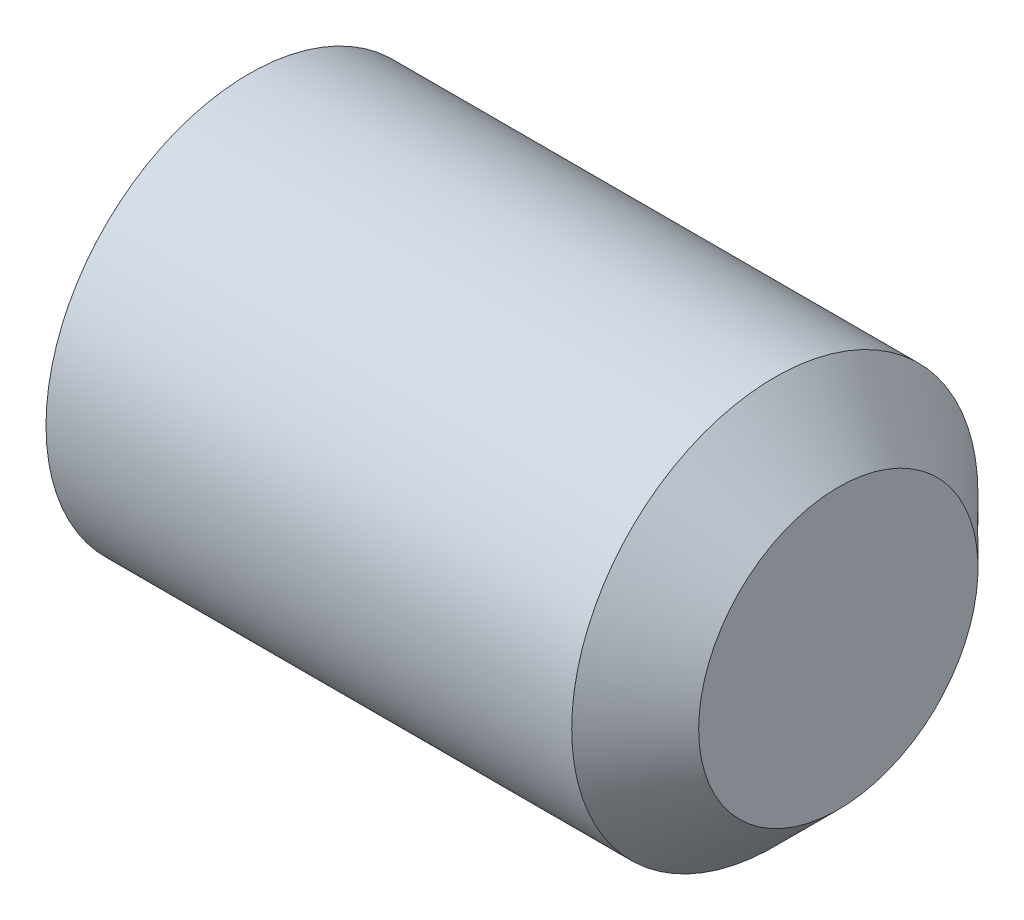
ISO-10303-21;
HEADER;
FILE_DESCRIPTION(('STEP AP214'),'2;1');
FILE_NAME('part.step','',(''),(''),'','','');
FILE_SCHEMA(('AUTOMOTIVE_DESIGN { 1 0 10303 214 1 1 1 1 }'));
ENDSEC;
DATA;
#1=APPLICATION_CONTEXT('core data for automotive mechanical design processes');
#2=APPLICATION_PROTOCOL_DEFINITION('international standard','automotive_design',2000,#1);
#3=PRODUCT_CONTEXT('',#1,'mechanical');
#4=PRODUCT('Part','Part','',(#3));
#5=PRODUCT_RELATED_PRODUCT_CATEGORY('part','',(#4));
#6=PRODUCT_DEFINITION_FORMATION('','',#4);
#7=PRODUCT_DEFINITION_CONTEXT('part definition',#1,'design');
#8=PRODUCT_DEFINITION('design','',#6,#7);
#9=PRODUCT_DEFINITION_SHAPE('','',#8);
#10=(LENGTH_UNIT() NAMED_UNIT(*) SI_UNIT(.MILLI.,.METRE.));
#11=(NAMED_UNIT(*) PLANE_ANGLE_UNIT() SI_UNIT($,.RADIAN.));
#12=(NAMED_UNIT(*) SI_UNIT($,.STERADIAN.) SOLID_ANGLE_UNIT());
#13=UNCERTAINTY_MEASURE_WITH_UNIT(LENGTH_MEASURE(1.E-05),#10,'distance_accuracy_value','');
#14=(GEOMETRIC_REPRESENTATION_CONTEXT(3) GLOBAL_UNCERTAINTY_ASSIGNED_CONTEXT((#13)) GLOBAL_UNIT_ASSIGNED_CONTEXT((#10,
#11,#12)) REPRESENTATION_CONTEXT('',''));
#15=CARTESIAN_POINT('',(0.,0.,0.));
#16=DIRECTION('',(0.,0.,1.));
#17=DIRECTION('',(1.,0.,0.));
#18=AXIS2_PLACEMENT_3D('',#15,#16,#17);
#19=CARTESIAN_POINT('',(0.,0.,0.));
#20=DIRECTION('',(-1.,0.,0.));
#21=DIRECTION('',(0.,0.,1.));
#22=AXIS2_PLACEMENT_3D('',#19,#20,#21);
#23=PLANE('',#22);
#24=CARTESIAN_POINT('',(0.,0.,0.));
#25=DIRECTION('',(-1.,0.,0.));
#26=DIRECTION('',(0.,0.,1.));
#27=AXIS2_PLACEMENT_3D('',#24,#25,#26);
#28=CIRCLE('',#27,3.3095);
#29=CARTESIAN_POINT('',(0.,0.,3.3095));
#30=VERTEX_POINT('',#29);
#31=EDGE_CURVE('E135',#30,#30,#28,.T.);
#32=ORIENTED_EDGE('',*,*,#31,.T.);
#33=EDGE_LOOP('',(#32));
#34=FACE_BOUND('',#33,.T.);
#35=DIRECTION('',(0.,0.,-1.));
#36=VECTOR('',#35,1.);
#37=CARTESIAN_POINT('',(0.,2.,1.15470053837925));
#38=LINE('',#37,#36);
#39=CARTESIAN_POINT('',(0.,2.,1.15470053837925));
#40=VERTEX_POINT('',#39);
#41=CARTESIAN_POINT('',(0.,2.,-1.15470053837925));
#42=VERTEX_POINT('',#41);
#43=EDGE_CURVE('E126',#40,#42,#38,.T.);
#44=ORIENTED_EDGE('',*,*,#43,.F.);
#45=DIRECTION('',(0.,-0.866025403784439,0.5));
#46=VECTOR('',#45,1.);
#47=CARTESIAN_POINT('',(0.,2.,1.15470053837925));
#48=LINE('',#47,#46);
#49=CARTESIAN_POINT('',(0.,0.,2.3094010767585));
#50=VERTEX_POINT('',#49);
#51=EDGE_CURVE('E48',#40,#50,#48,.T.);
#52=ORIENTED_EDGE('',*,*,#51,.T.);
#53=DIRECTION('',(0.,0.866025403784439,0.5));
#54=VECTOR('',#53,1.);
#55=CARTESIAN_POINT('',(0.,-2.,1.15470053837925));
#56=LINE('',#55,#54);
#57=CARTESIAN_POINT('',(0.,-2.,1.15470053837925));
#58=VERTEX_POINT('',#57);
#59=EDGE_CURVE('E117',#58,#50,#56,.T.);
#60=ORIENTED_EDGE('',*,*,#59,.F.);
#61=DIRECTION('',(0.,0.,-1.));
#62=VECTOR('',#61,1.);
#63=CARTESIAN_POINT('',(0.,-2.,1.15470053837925));
#64=LINE('',#63,#62);
#65=CARTESIAN_POINT('',(0.,-2.,-1.15470053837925));
#66=VERTEX_POINT('',#65);
#67=EDGE_CURVE('E120',#58,#66,#64,.T.);
#68=ORIENTED_EDGE('',*,*,#67,.T.);
#69=DIRECTION('',(0.,0.866025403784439,-0.5));
#70=VECTOR('',#69,1.);
#71=CARTESIAN_POINT('',(0.,-2.,-1.15470053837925));
#72=LINE('',#71,#70);
#73=CARTESIAN_POINT('',(0.,0.,-2.30940107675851));
#74=VERTEX_POINT('',#73);
#75=EDGE_CURVE('E123',#66,#74,#72,.T.);
#76=ORIENTED_EDGE('',*,*,#75,.T.);
#77=DIRECTION('',(0.,-0.866025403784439,-0.5));
#78=VECTOR('',#77,1.);
#79=CARTESIAN_POINT('',(0.,2.,-1.15470053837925));
#80=LINE('',#79,#78);
#81=EDGE_CURVE('E106',#42,#74,#80,.T.);
#82=ORIENTED_EDGE('',*,*,#81,.F.);
#83=EDGE_LOOP('',(#44,#52,#60,#68,#76,#82));
#84=FACE_BOUND('',#83,.T.);
#85=ADVANCED_FACE('F33',(#34,#84),#23,.T.);
#86=CARTESIAN_POINT('',(12.,2.75,0.));
#87=DIRECTION('',(1.,0.,0.));
#88=DIRECTION('',(0.,0.,-1.));
#89=AXIS2_PLACEMENT_3D('',#86,#87,#88);
#90=PLANE('',#89);
#91=CARTESIAN_POINT('',(12.,0.,0.));
#92=DIRECTION('',(-1.,0.,0.));
#93=DIRECTION('',(0.,0.,1.));
#94=AXIS2_PLACEMENT_3D('',#91,#92,#93);
#95=CIRCLE('',#94,2.75);
#96=CARTESIAN_POINT('',(12.,0.,2.75));
#97=VERTEX_POINT('',#96);
#98=EDGE_CURVE('E11',#97,#97,#95,.T.);
#99=ORIENTED_EDGE('',*,*,#98,.F.);
#100=EDGE_LOOP('',(#99));
#101=FACE_BOUND('',#100,.T.);
#102=ADVANCED_FACE('F35',(#101),#90,.T.);
#103=CARTESIAN_POINT('',(10.75,0.,0.));
#104=DIRECTION('',(-1.,0.,0.));
#105=DIRECTION('',(0.,0.,1.));
#106=AXIS2_PLACEMENT_3D('',#103,#104,#105);
#107=CONICAL_SURFACE('',#106,4.,0.785398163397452);
#108=ORIENTED_EDGE('',*,*,#98,.T.);
#109=EDGE_LOOP('',(#108));
#110=FACE_BOUND('',#109,.T.);
#111=CARTESIAN_POINT('',(10.75,0.,0.));
#112=DIRECTION('',(-1.,0.,0.));
#113=DIRECTION('',(0.,0.,1.));
#114=AXIS2_PLACEMENT_3D('',#111,#112,#113);
#115=CIRCLE('',#114,4.);
#116=CARTESIAN_POINT('',(10.75,0.,4.));
#117=VERTEX_POINT('',#116);
#118=EDGE_CURVE('E41',#117,#117,#115,.T.);
#119=ORIENTED_EDGE('',*,*,#118,.F.);
#120=EDGE_LOOP('',(#119));
#121=FACE_BOUND('',#120,.T.);
#122=ADVANCED_FACE('F146',(#110,#121),#107,.T.);
#123=CARTESIAN_POINT('',(-12.7,0.,0.));
#124=DIRECTION('',(-1.,0.,0.));
#125=DIRECTION('',(0.,0.,1.));
#126=AXIS2_PLACEMENT_3D('',#123,#124,#125);
#127=CYLINDRICAL_SURFACE('',#126,4.);
#128=ORIENTED_EDGE('',*,*,#118,.T.);
#129=EDGE_LOOP('',(#128));
#130=FACE_BOUND('',#129,.T.);
#131=CARTESIAN_POINT('',(0.398660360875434,0.,0.));
#132=DIRECTION('',(-1.,0.,0.));
#133=DIRECTION('',(0.,0.,1.));
#134=AXIS2_PLACEMENT_3D('',#131,#132,#133);
#135=CIRCLE('',#134,4.);
#136=CARTESIAN_POINT('',(0.398660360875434,0.,4.));
#137=VERTEX_POINT('',#136);
#138=EDGE_CURVE('E138',#137,#137,#135,.T.);
#139=ORIENTED_EDGE('',*,*,#138,.F.);
#140=EDGE_LOOP('',(#139));
#141=FACE_BOUND('',#140,.T.);
#142=ADVANCED_FACE('F143',(#130,#141),#127,.T.);
#143=CARTESIAN_POINT('',(0.,0.,0.));
#144=DIRECTION('',(1.,0.,0.));
#145=DIRECTION('',(0.,0.,-1.));
#146=AXIS2_PLACEMENT_3D('',#143,#144,#145);
#147=CONICAL_SURFACE('',#146,3.3095,1.0471975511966);
#148=ORIENTED_EDGE('',*,*,#138,.T.);
#149=EDGE_LOOP('',(#148));
#150=FACE_BOUND('',#149,.T.);
#151=ORIENTED_EDGE('',*,*,#31,.F.);
#152=EDGE_LOOP('',(#151));
#153=FACE_BOUND('',#152,.T.);
#154=ADVANCED_FACE('F153',(#150,#153),#147,.T.);
#155=CARTESIAN_POINT('',(5.,2.,1.15470053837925));
#156=DIRECTION('',(0.,-0.5,-0.866025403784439));
#157=DIRECTION('',(0.,0.866025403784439,-0.5));
#158=AXIS2_PLACEMENT_3D('',#155,#156,#157);
#159=PLANE('',#158);
#160=ORIENTED_EDGE('',*,*,#51,.F.);
#161=DIRECTION('',(-1.,0.,0.));
#162=VECTOR('',#161,1.);
#163=CARTESIAN_POINT('',(5.,2.,1.15470053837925));
#164=LINE('',#163,#162);
#165=CARTESIAN_POINT('',(5.,2.,1.15470053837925));
#166=VERTEX_POINT('',#165);
#167=EDGE_CURVE('E53',#166,#40,#164,.T.);
#168=ORIENTED_EDGE('',*,*,#167,.F.);
#169=DIRECTION('',(0.,-0.866025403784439,0.5));
#170=VECTOR('',#169,1.);
#171=CARTESIAN_POINT('',(5.,2.,1.15470053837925));
#172=LINE('',#171,#170);
#173=CARTESIAN_POINT('',(5.,0.,2.3094010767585));
#174=VERTEX_POINT('',#173);
#175=EDGE_CURVE('E80',#166,#174,#172,.T.);
#176=ORIENTED_EDGE('',*,*,#175,.T.);
#177=DIRECTION('',(-1.,0.,0.));
#178=VECTOR('',#177,1.);
#179=CARTESIAN_POINT('',(5.,0.,2.3094010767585));
#180=LINE('',#179,#178);
#181=EDGE_CURVE('E133',#174,#50,#180,.T.);
#182=ORIENTED_EDGE('',*,*,#181,.T.);
#183=EDGE_LOOP('',(#160,#168,#176,#182));
#184=FACE_BOUND('',#183,.T.);
#185=ADVANCED_FACE('F164',(#184),#159,.T.);
#186=CARTESIAN_POINT('',(5.,-2.,1.15470053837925));
#187=DIRECTION('',(0.,-0.5,0.866025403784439));
#188=DIRECTION('',(0.,-0.866025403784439,-0.5));
#189=AXIS2_PLACEMENT_3D('',#186,#187,#188);
#190=PLANE('',#189);
#191=ORIENTED_EDGE('',*,*,#59,.T.);
#192=ORIENTED_EDGE('',*,*,#181,.F.);
#193=DIRECTION('',(0.,0.866025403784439,0.5));
#194=VECTOR('',#193,1.);
#195=CARTESIAN_POINT('',(5.,-2.,1.15470053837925));
#196=LINE('',#195,#194);
#197=CARTESIAN_POINT('',(5.,-2.,1.15470053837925));
#198=VERTEX_POINT('',#197);
#199=EDGE_CURVE('E262',#198,#174,#196,.T.);
#200=ORIENTED_EDGE('',*,*,#199,.F.);
#201=DIRECTION('',(-1.,0.,0.));
#202=VECTOR('',#201,1.);
#203=CARTESIAN_POINT('',(5.,-2.,1.15470053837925));
#204=LINE('',#203,#202);
#205=EDGE_CURVE('E131',#198,#58,#204,.T.);
#206=ORIENTED_EDGE('',*,*,#205,.T.);
#207=EDGE_LOOP('',(#191,#192,#200,#206));
#208=FACE_BOUND('',#207,.T.);
#209=ADVANCED_FACE('F171',(#208),#190,.F.);
#210=CARTESIAN_POINT('',(5.,-2.,1.15470053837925));
#211=DIRECTION('',(0.,1.,0.));
#212=DIRECTION('',(0.,0.,1.));
#213=AXIS2_PLACEMENT_3D('',#210,#211,#212);
#214=PLANE('',#213);
#215=ORIENTED_EDGE('',*,*,#67,.F.);
#216=ORIENTED_EDGE('',*,*,#205,.F.);
#217=DIRECTION('',(0.,0.,-1.));
#218=VECTOR('',#217,1.);
#219=CARTESIAN_POINT('',(5.,-2.,1.15470053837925));
#220=LINE('',#219,#218);
#221=CARTESIAN_POINT('',(5.,-2.,-1.15470053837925));
#222=VERTEX_POINT('',#221);
#223=EDGE_CURVE('E101',#198,#222,#220,.T.);
#224=ORIENTED_EDGE('',*,*,#223,.T.);
#225=DIRECTION('',(-1.,0.,0.));
#226=VECTOR('',#225,1.);
#227=CARTESIAN_POINT('',(5.,-2.,-1.15470053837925));
#228=LINE('',#227,#226);
#229=EDGE_CURVE('E96',#222,#66,#228,.T.);
#230=ORIENTED_EDGE('',*,*,#229,.T.);
#231=EDGE_LOOP('',(#215,#216,#224,#230));
#232=FACE_BOUND('',#231,.T.);
#233=ADVANCED_FACE('F178',(#232),#214,.T.);
#234=CARTESIAN_POINT('',(5.,-2.,-1.15470053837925));
#235=DIRECTION('',(0.,0.5,0.866025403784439));
#236=DIRECTION('',(0.,-0.866025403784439,0.5));
#237=AXIS2_PLACEMENT_3D('',#234,#235,#236);
#238=PLANE('',#237);
#239=ORIENTED_EDGE('',*,*,#75,.F.);
#240=ORIENTED_EDGE('',*,*,#229,.F.);
#241=DIRECTION('',(0.,0.866025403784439,-0.5));
#242=VECTOR('',#241,1.);
#243=CARTESIAN_POINT('',(5.,-2.,-1.15470053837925));
#244=LINE('',#243,#242);
#245=CARTESIAN_POINT('',(5.,0.,-2.30940107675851));
#246=VERTEX_POINT('',#245);
#247=EDGE_CURVE('E91',#222,#246,#244,.T.);
#248=ORIENTED_EDGE('',*,*,#247,.T.);
#249=DIRECTION('',(-1.,0.,0.));
#250=VECTOR('',#249,1.);
#251=CARTESIAN_POINT('',(5.,0.,-2.30940107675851));
#252=LINE('',#251,#250);
#253=EDGE_CURVE('E95',#246,#74,#252,.T.);
#254=ORIENTED_EDGE('',*,*,#253,.T.);
#255=EDGE_LOOP('',(#239,#240,#248,#254));
#256=FACE_BOUND('',#255,.T.);
#257=ADVANCED_FACE('F94',(#256),#238,.T.);
#258=CARTESIAN_POINT('',(5.,2.,-1.15470053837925));
#259=DIRECTION('',(0.,0.5,-0.866025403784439));
#260=DIRECTION('',(0.,0.866025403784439,0.5));
#261=AXIS2_PLACEMENT_3D('',#258,#259,#260);
#262=PLANE('',#261);
#263=ORIENTED_EDGE('',*,*,#81,.T.);
#264=ORIENTED_EDGE('',*,*,#253,.F.);
#265=DIRECTION('',(0.,-0.866025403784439,-0.5));
#266=VECTOR('',#265,1.);
#267=CARTESIAN_POINT('',(5.,2.,-1.15470053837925));
#268=LINE('',#267,#266);
#269=CARTESIAN_POINT('',(5.,2.,-1.15470053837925));
#270=VERTEX_POINT('',#269);
#271=EDGE_CURVE('E100',#270,#246,#268,.T.);
#272=ORIENTED_EDGE('',*,*,#271,.F.);
#273=DIRECTION('',(-1.,0.,0.));
#274=VECTOR('',#273,1.);
#275=CARTESIAN_POINT('',(5.,2.,-1.15470053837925));
#276=LINE('',#275,#274);
#277=EDGE_CURVE('E76',#270,#42,#276,.T.);
#278=ORIENTED_EDGE('',*,*,#277,.T.);
#279=EDGE_LOOP('',(#263,#264,#272,#278));
#280=FACE_BOUND('',#279,.T.);
#281=ADVANCED_FACE('F103',(#280),#262,.F.);
#282=CARTESIAN_POINT('',(5.,2.,1.15470053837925));
#283=DIRECTION('',(0.,1.,0.));
#284=DIRECTION('',(0.,0.,1.));
#285=AXIS2_PLACEMENT_3D('',#282,#283,#284);
#286=PLANE('',#285);
#287=ORIENTED_EDGE('',*,*,#43,.T.);
#288=ORIENTED_EDGE('',*,*,#277,.F.);
#289=DIRECTION('',(0.,0.,-1.));
#290=VECTOR('',#289,1.);
#291=CARTESIAN_POINT('',(5.,2.,1.15470053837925));
#292=LINE('',#291,#290);
#293=EDGE_CURVE('E111',#166,#270,#292,.T.);
#294=ORIENTED_EDGE('',*,*,#293,.F.);
#295=ORIENTED_EDGE('',*,*,#167,.T.);
#296=EDGE_LOOP('',(#287,#288,#294,#295));
#297=FACE_BOUND('',#296,.T.);
#298=ADVANCED_FACE('F190',(#297),#286,.F.);
#299=CARTESIAN_POINT('',(5.,2.,1.15470053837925));
#300=DIRECTION('',(1.,0.,0.));
#301=DIRECTION('',(0.,0.,-1.));
#302=AXIS2_PLACEMENT_3D('',#299,#300,#301);
#303=PLANE('',#302);
#304=ORIENTED_EDGE('',*,*,#175,.F.);
#305=ORIENTED_EDGE('',*,*,#293,.T.);
#306=ORIENTED_EDGE('',*,*,#271,.T.);
#307=ORIENTED_EDGE('',*,*,#247,.F.);
#308=ORIENTED_EDGE('',*,*,#223,.F.);
#309=ORIENTED_EDGE('',*,*,#199,.T.);
#310=EDGE_LOOP('',(#304,#305,#306,#307,#308,#309));
#311=FACE_BOUND('',#310,.T.);
#312=ADVANCED_FACE('F109',(#311),#303,.F.);
#313=CLOSED_SHELL('',(#85,#102,#122,#142,#154,#185,#209,#233,#257,#281,#298,#312));
#314=MANIFOLD_SOLID_BREP('B2',#313);
#315=ADVANCED_BREP_SHAPE_REPRESENTATION('',(#18,#314),#14);
#316=SHAPE_DEFINITION_REPRESENTATION(#9,#315);
ENDSEC;
END-ISO-10303-21;
